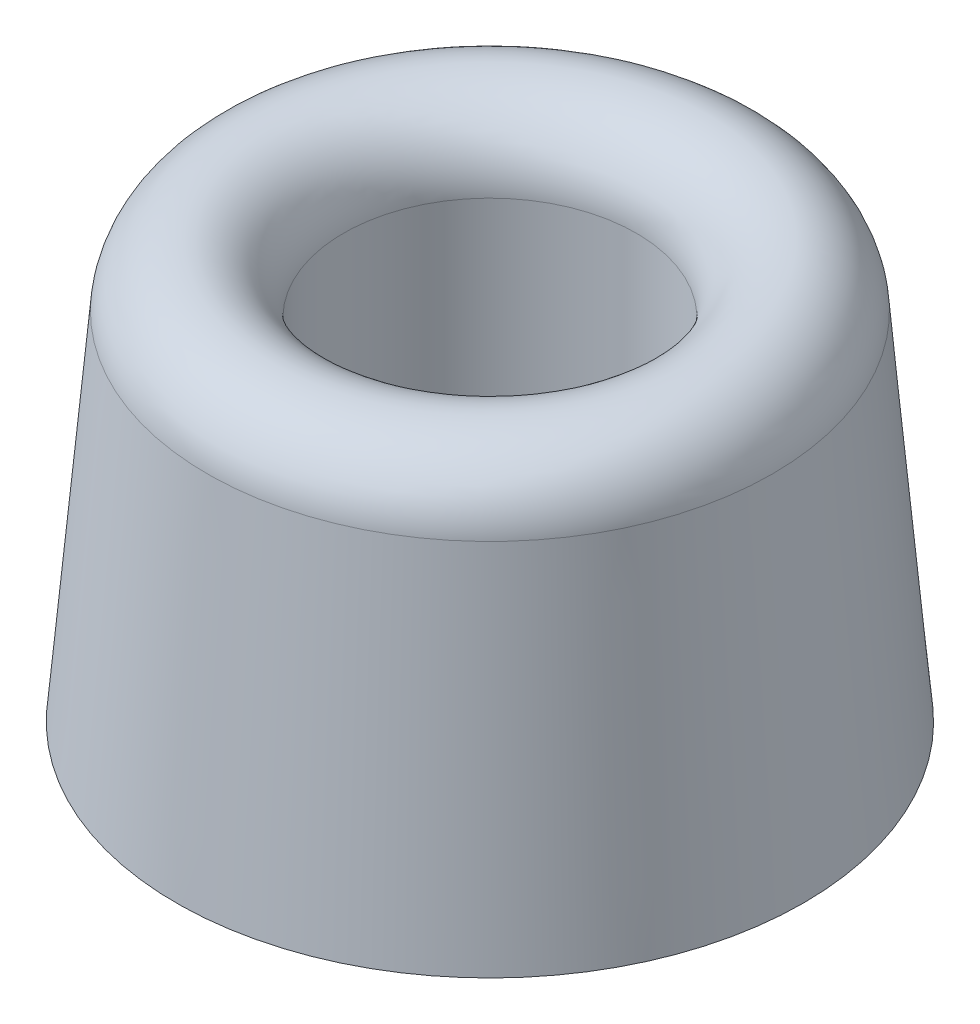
ISO-10303-21;
HEADER;
FILE_DESCRIPTION(('STEP AP214'),'2;1');
FILE_NAME('part.step','',(''),(''),'','','');
FILE_SCHEMA(('AUTOMOTIVE_DESIGN { 1 0 10303 214 1 1 1 1 }'));
ENDSEC;
DATA;
#1=APPLICATION_CONTEXT('core data for automotive mechanical design processes');
#2=APPLICATION_PROTOCOL_DEFINITION('international standard','automotive_design',2000,#1);
#3=PRODUCT_CONTEXT('',#1,'mechanical');
#4=PRODUCT('Part','Part','',(#3));
#5=PRODUCT_RELATED_PRODUCT_CATEGORY('part','',(#4));
#6=PRODUCT_DEFINITION_FORMATION('','',#4);
#7=PRODUCT_DEFINITION_CONTEXT('part definition',#1,'design');
#8=PRODUCT_DEFINITION('design','',#6,#7);
#9=PRODUCT_DEFINITION_SHAPE('','',#8);
#10=(LENGTH_UNIT() NAMED_UNIT(*) SI_UNIT(.MILLI.,.METRE.));
#11=(NAMED_UNIT(*) PLANE_ANGLE_UNIT() SI_UNIT($,.RADIAN.));
#12=(NAMED_UNIT(*) SI_UNIT($,.STERADIAN.) SOLID_ANGLE_UNIT());
#13=UNCERTAINTY_MEASURE_WITH_UNIT(LENGTH_MEASURE(1.E-05),#10,'distance_accuracy_value','');
#14=(GEOMETRIC_REPRESENTATION_CONTEXT(3) GLOBAL_UNCERTAINTY_ASSIGNED_CONTEXT((#13)) GLOBAL_UNIT_ASSIGNED_CONTEXT((#10,
#11,#12)) REPRESENTATION_CONTEXT('',''));
#15=CARTESIAN_POINT('',(0.,0.,0.));
#16=DIRECTION('',(0.,0.,1.));
#17=DIRECTION('',(1.,0.,0.));
#18=AXIS2_PLACEMENT_3D('',#15,#16,#17);
#19=CARTESIAN_POINT('',(0.,8.74927194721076,0.));
#20=DIRECTION('',(0.,-1.,0.));
#21=DIRECTION('',(1.,0.,0.));
#22=AXIS2_PLACEMENT_3D('',#19,#20,#21);
#23=CONICAL_SURFACE('',#22,10.7241231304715,0.0872664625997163);
#24=CARTESIAN_POINT('',(0.,-4.7625,0.));
#25=DIRECTION('',(0.,-1.,0.));
#26=DIRECTION('',(1.,0.,0.));
#27=AXIS2_PLACEMENT_3D('',#24,#25,#26);
#28=CIRCLE('',#27,11.90625);
#29=CARTESIAN_POINT('',(11.90625,-4.7625,0.));
#30=VERTEX_POINT('',#29);
#31=EDGE_CURVE('E52',#30,#30,#28,.T.);
#32=ORIENTED_EDGE('',*,*,#31,.F.);
#33=EDGE_LOOP('',(#32));
#34=FACE_BOUND('',#33,.T.);
#35=CARTESIAN_POINT('',(0.,8.74927194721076,0.));
#36=DIRECTION('',(0.,-1.,0.));
#37=DIRECTION('',(1.,0.,0.));
#38=AXIS2_PLACEMENT_3D('',#35,#36,#37);
#39=CIRCLE('',#38,10.7241231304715);
#40=CARTESIAN_POINT('',(10.7241231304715,8.74927194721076,0.));
#41=VERTEX_POINT('',#40);
#42=EDGE_CURVE('E10',#41,#41,#39,.T.);
#43=ORIENTED_EDGE('',*,*,#42,.T.);
#44=EDGE_LOOP('',(#43));
#45=FACE_BOUND('',#44,.T.);
#46=ADVANCED_FACE('F30',(#34,#45),#23,.T.);
#47=CARTESIAN_POINT('',(0.,8.52363773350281,0.));
#48=DIRECTION('',(0.,-1.,0.));
#49=DIRECTION('',(1.,0.,0.));
#50=AXIS2_PLACEMENT_3D('',#47,#48,#49);
#51=TOROIDAL_SURFACE('',#50,8.14511226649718,2.58886226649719);
#52=ORIENTED_EDGE('',*,*,#42,.F.);
#53=EDGE_LOOP('',(#52));
#54=FACE_BOUND('',#53,.T.);
#55=CARTESIAN_POINT('',(0.,8.52363773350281,0.));
#56=DIRECTION('',(0.,-1.,0.));
#57=DIRECTION('',(1.,0.,0.));
#58=AXIS2_PLACEMENT_3D('',#55,#56,#57);
#59=CIRCLE('',#58,5.55625);
#60=CARTESIAN_POINT('',(5.55625,8.52363773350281,0.));
#61=VERTEX_POINT('',#60);
#62=EDGE_CURVE('E36',#61,#61,#59,.T.);
#63=ORIENTED_EDGE('',*,*,#62,.T.);
#64=EDGE_LOOP('',(#63));
#65=FACE_BOUND('',#64,.T.);
#66=ADVANCED_FACE('F59',(#54,#65),#51,.T.);
#67=CARTESIAN_POINT('',(0.,-4.7625,0.));
#68=DIRECTION('',(0.,-1.,0.));
#69=DIRECTION('',(1.,0.,0.));
#70=AXIS2_PLACEMENT_3D('',#67,#68,#69);
#71=CYLINDRICAL_SURFACE('',#70,5.55625);
#72=ORIENTED_EDGE('',*,*,#62,.F.);
#73=EDGE_LOOP('',(#72));
#74=FACE_BOUND('',#73,.T.);
#75=CARTESIAN_POINT('',(0.,0.,0.));
#76=DIRECTION('',(0.,-1.,0.));
#77=DIRECTION('',(1.,0.,0.));
#78=AXIS2_PLACEMENT_3D('',#75,#76,#77);
#79=CIRCLE('',#78,5.55625);
#80=CARTESIAN_POINT('',(5.55625,0.,0.));
#81=VERTEX_POINT('',#80);
#82=EDGE_CURVE('E40',#81,#81,#79,.T.);
#83=ORIENTED_EDGE('',*,*,#82,.T.);
#84=EDGE_LOOP('',(#83));
#85=FACE_BOUND('',#84,.T.);
#86=ADVANCED_FACE('F63',(#74,#85),#71,.F.);
#87=CARTESIAN_POINT('',(-5.55625,0.,0.));
#88=DIRECTION('',(0.,-1.,0.));
#89=DIRECTION('',(1.,0.,0.));
#90=AXIS2_PLACEMENT_3D('',#87,#88,#89);
#91=PLANE('',#90);
#92=ORIENTED_EDGE('',*,*,#82,.F.);
#93=EDGE_LOOP('',(#92));
#94=FACE_BOUND('',#93,.T.);
#95=CARTESIAN_POINT('',(0.,0.,0.));
#96=DIRECTION('',(0.,-1.,0.));
#97=DIRECTION('',(1.,0.,0.));
#98=AXIS2_PLACEMENT_3D('',#95,#96,#97);
#99=CIRCLE('',#98,2.778125);
#100=CARTESIAN_POINT('',(2.778125,0.,0.));
#101=VERTEX_POINT('',#100);
#102=EDGE_CURVE('E44',#101,#101,#99,.T.);
#103=ORIENTED_EDGE('',*,*,#102,.T.);
#104=EDGE_LOOP('',(#103));
#105=FACE_BOUND('',#104,.T.);
#106=ADVANCED_FACE('F68',(#94,#105),#91,.F.);
#107=CARTESIAN_POINT('',(0.,-4.7625,0.));
#108=DIRECTION('',(0.,-1.,0.));
#109=DIRECTION('',(1.,0.,0.));
#110=AXIS2_PLACEMENT_3D('',#107,#108,#109);
#111=CYLINDRICAL_SURFACE('',#110,2.778125);
#112=ORIENTED_EDGE('',*,*,#102,.F.);
#113=EDGE_LOOP('',(#112));
#114=FACE_BOUND('',#113,.T.);
#115=CARTESIAN_POINT('',(0.,-4.7625,0.));
#116=DIRECTION('',(0.,-1.,0.));
#117=DIRECTION('',(1.,0.,0.));
#118=AXIS2_PLACEMENT_3D('',#115,#116,#117);
#119=CIRCLE('',#118,2.778125);
#120=CARTESIAN_POINT('',(2.778125,-4.7625,0.));
#121=VERTEX_POINT('',#120);
#122=EDGE_CURVE('E49',#121,#121,#119,.T.);
#123=ORIENTED_EDGE('',*,*,#122,.T.);
#124=EDGE_LOOP('',(#123));
#125=FACE_BOUND('',#124,.T.);
#126=ADVANCED_FACE('F74',(#114,#125),#111,.F.);
#127=CARTESIAN_POINT('',(-2.778125,-4.7625,0.));
#128=DIRECTION('',(0.,1.,0.));
#129=DIRECTION('',(-1.,0.,0.));
#130=AXIS2_PLACEMENT_3D('',#127,#128,#129);
#131=PLANE('',#130);
#132=ORIENTED_EDGE('',*,*,#122,.F.);
#133=EDGE_LOOP('',(#132));
#134=FACE_BOUND('',#133,.T.);
#135=ORIENTED_EDGE('',*,*,#31,.T.);
#136=EDGE_LOOP('',(#135));
#137=FACE_BOUND('',#136,.T.);
#138=ADVANCED_FACE('F56',(#134,#137),#131,.F.);
#139=CLOSED_SHELL('',(#46,#66,#86,#106,#126,#138));
#140=MANIFOLD_SOLID_BREP('B2',#139);
#141=ADVANCED_BREP_SHAPE_REPRESENTATION('',(#18,#140),#14);
#142=SHAPE_DEFINITION_REPRESENTATION(#9,#141);
ENDSEC;
END-ISO-10303-21;
